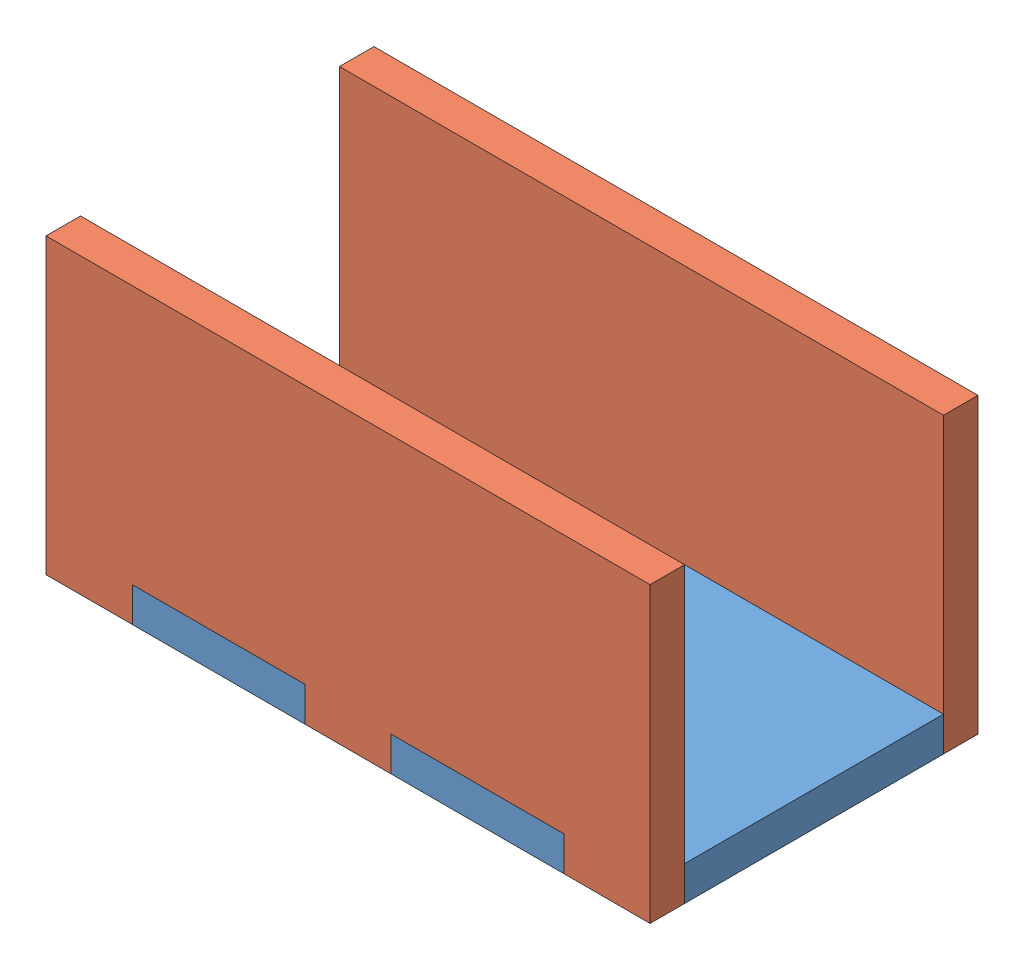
SolidWorks assembly MicCaseASSEM.SLDASM, configuration Default (file format 10000). Lengths in mm.
Overall size (35 17 19).
3 component instances, 2 part files, 7 mates.
Components (placement in the parent):
- micCaseBase-1: micCaseBase.SLDPRT [Default] at origin size (35 2 19)
- micCaseSide-2: micCaseSide.sldprt [Default] at (0 2 0) x (1 0 0) z (0 1 0) size (35 2 17)
- micCaseSide-3: micCaseSide.sldprt [Default] at (0 2 -17) x (1 0 0) z (0 1 0) size (35 2 17)
Mates (geometry in assembly coordinates):
- InPlace2: in place: plane of micCaseBase-1 through (0 2 0) normal (0 1 0); plane of micCaseSide-2 through (0 2 0) normal (0 1 0); moOrthogonalPlaneRef_w of micCaseBase-1 through (0 2 0) normal (0 1 0); plane of micCaseSide-2 through (0 2 0) normal (0 0 -1); plane of micCaseBase-1 through (0 2 0) normal (0 1 0); plane of micCaseSide-2 through (0 2 0) normal (1 0 0); plane of micCaseBase-1 through (0 2 0) normal (0 1 0); unknown of micCaseSide-2
- Coincident4: coincident aligned: plane of micCaseBase-1; plane of micCaseSide-2
- Coincident5: coincident aligned: moOrthogonalPlaneRef_w of micCaseBase-1 through (0 2 0) normal (0 0 -1); plane of micCaseSide-2 through (0 2 0) normal (0 0 -1)
- Coincident6: coincident anti-aligned: moOrthogonalPlaneRef_w of micCaseBase-1 through (0 2 0) normal (-1 0 0); plane of micCaseSide-2 through (0 2 0) normal (1 0 0)
- Coincident7: coincident: plane of micCaseBase-1 through (0 0 -17) normal (0 0 -1); plane of micCaseSide-3 through (0 0 -17) normal (0 0 -1)
- Coincident8: coincident: plane of micCaseBase-1 through (35 2 0) normal (1 0 0); plane of micCaseSide-3 through (35 0 -17) normal (1 0 0)
- Coincident9: coincident aligned: plane of micCaseBase-1 through (0 0 0) normal (0 -1 0); plane of micCaseSide-3 through (0 0 -17) normal (0 -1 0)
